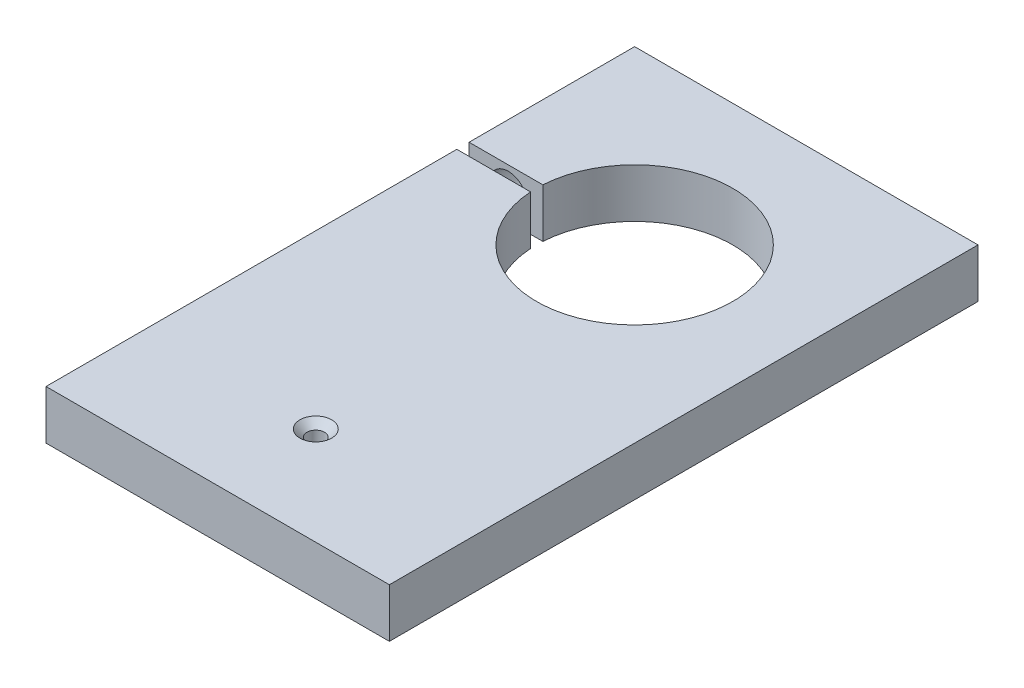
from build123d import *

# Parameters (mm, degrees)
EXTRUDE1_DEPTH                  = 6.35
F_8_CLEARANCE_HOLE1_D           = 4.9149
F_8_CLEARANCE_HOLE1_DEPTH       = 21.59
F_8_CLEARANCE_HOLE1_TIP         = 1.476584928
F_8_32_TAPPED_HOLE1_D           = 3.4544
F_8_32_TAPPED_HOLE1_DEPTH       = 34.4424
F_8_32_TAPPED_HOLE1_CSINK_D     = 4.7244
F_8_32_TAPPED_HOLE1_CSINK_ANGLE = 90
F_8_32_TAPPED_HOLE1_TIP         = 1.037806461
F_4_40_TAPPED_HOLE1_D           = 2.2606
F_4_40_TAPPED_HOLE1_CSINK_D     = 4.1148
F_4_40_TAPPED_HOLE1_CSINK_ANGLE = 90


with BuildPart() as part:
    # Sketch1 → Extrude1 (new body)
    with BuildSketch(Plane(origin=(0, 0, 0), x_dir=(1, 0, 0), z_dir=(0, 1, 0))):
        with BuildLine():
            Line((22.225, 38.1), (-22.225, 38.1))
            Line((-22.225, 38.1), (-22.225, 16.66875))
            Line((-22.225, 16.66875), (-12.675171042, 16.66875))
            ThreePointArc((-12.675171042, 16.66875), (0.397069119, 28.568791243), (12.7, 15.875))
            ThreePointArc((12.7, 15.875), (0.397069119, 3.181208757), (-12.675171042, 15.08125))
            Line((-12.675171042, 15.08125), (-22.225, 15.08125))
            Line((-22.225, 15.08125), (-22.225, -38.1))
            Line((-22.225, -38.1), (22.225, -38.1))
            Line((22.225, -38.1), (22.225, 38.1))
        make_face()
    extrude(amount=EXTRUDE1_DEPTH)

    # 8 Clearance Hole1
    with Locations(Plane(origin=(-17.145, 3.175, -38.1), x_dir=(-1, 0, 0), z_dir=(0, 0, -1))):
        with Locations((0, 0)):
            Hole(F_8_CLEARANCE_HOLE1_D / 2, depth=F_8_CLEARANCE_HOLE1_DEPTH)
            with Locations((0, 0, -(F_8_CLEARANCE_HOLE1_DEPTH + F_8_CLEARANCE_HOLE1_TIP / 2))):  # 118° drill point
                Cone(0, F_8_CLEARANCE_HOLE1_D / 2, F_8_CLEARANCE_HOLE1_TIP, mode=Mode.SUBTRACT)

    # 8-32 Tapped Hole1
    with Locations(Plane(origin=(-17.145, 3.175, -38.1), x_dir=(-1, 0, 0), z_dir=(0, 0, -1))):
        with Locations((0, 0)):
            CounterSinkHole(F_8_32_TAPPED_HOLE1_D / 2, F_8_32_TAPPED_HOLE1_CSINK_D / 2, depth=F_8_32_TAPPED_HOLE1_DEPTH, counter_sink_angle=F_8_32_TAPPED_HOLE1_CSINK_ANGLE)
            with Locations((0, 0, -(F_8_32_TAPPED_HOLE1_DEPTH + F_8_32_TAPPED_HOLE1_TIP / 2))):  # 118° drill point
                Cone(0, F_8_32_TAPPED_HOLE1_D / 2, F_8_32_TAPPED_HOLE1_TIP, mode=Mode.SUBTRACT)

    # 4-40 Tapped Hole1 (through all)
    with Locations(Plane(origin=(0, 6.35, 25.4), x_dir=(0, 0, 1), z_dir=(0, 1, 0))):
        with Locations((0, 0)):
            CounterSinkHole(F_4_40_TAPPED_HOLE1_D / 2, F_4_40_TAPPED_HOLE1_CSINK_D / 2, counter_sink_angle=F_4_40_TAPPED_HOLE1_CSINK_ANGLE)


solid = part.part
